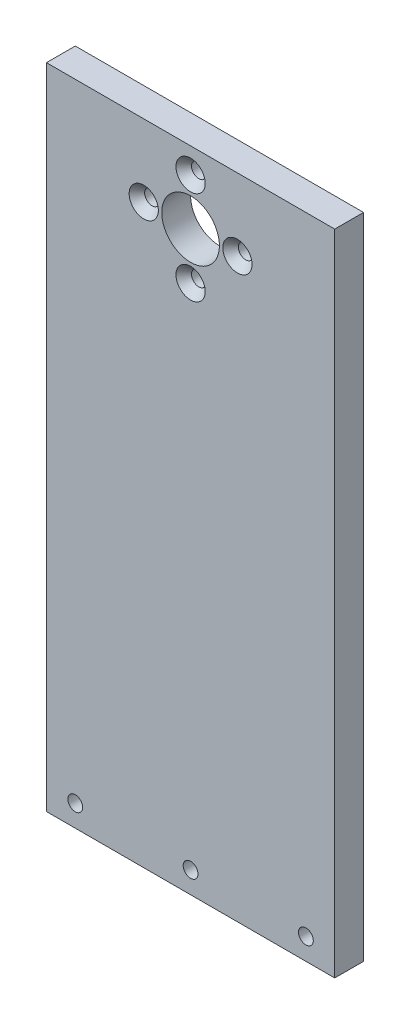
ISO-10303-21;
HEADER;
FILE_DESCRIPTION(('STEP AP214'),'2;1');
FILE_NAME('part.step','',(''),(''),'','','');
FILE_SCHEMA(('AUTOMOTIVE_DESIGN { 1 0 10303 214 1 1 1 1 }'));
ENDSEC;
DATA;
#1=APPLICATION_CONTEXT('core data for automotive mechanical design processes');
#2=APPLICATION_PROTOCOL_DEFINITION('international standard','automotive_design',2000,#1);
#3=PRODUCT_CONTEXT('',#1,'mechanical');
#4=PRODUCT('Part','Part','',(#3));
#5=PRODUCT_RELATED_PRODUCT_CATEGORY('part','',(#4));
#6=PRODUCT_DEFINITION_FORMATION('','',#4);
#7=PRODUCT_DEFINITION_CONTEXT('part definition',#1,'design');
#8=PRODUCT_DEFINITION('design','',#6,#7);
#9=PRODUCT_DEFINITION_SHAPE('','',#8);
#10=(LENGTH_UNIT() NAMED_UNIT(*) SI_UNIT(.MILLI.,.METRE.));
#11=(NAMED_UNIT(*) PLANE_ANGLE_UNIT() SI_UNIT($,.RADIAN.));
#12=(NAMED_UNIT(*) SI_UNIT($,.STERADIAN.) SOLID_ANGLE_UNIT());
#13=UNCERTAINTY_MEASURE_WITH_UNIT(LENGTH_MEASURE(1.E-05),#10,'distance_accuracy_value','');
#14=(GEOMETRIC_REPRESENTATION_CONTEXT(3) GLOBAL_UNCERTAINTY_ASSIGNED_CONTEXT((#13)) GLOBAL_UNIT_ASSIGNED_CONTEXT((#10,
#11,#12)) REPRESENTATION_CONTEXT('',''));
#15=CARTESIAN_POINT('',(0.,0.,0.));
#16=DIRECTION('',(0.,0.,1.));
#17=DIRECTION('',(1.,0.,0.));
#18=AXIS2_PLACEMENT_3D('',#15,#16,#17);
#19=CARTESIAN_POINT('',(-63.5,31.75,12.7));
#20=DIRECTION('',(1.,0.,0.));
#21=DIRECTION('',(0.,1.,0.));
#22=AXIS2_PLACEMENT_3D('',#19,#20,#21);
#23=PLANE('',#22);
#24=DIRECTION('',(0.,-1.,0.));
#25=VECTOR('',#24,1.);
#26=CARTESIAN_POINT('',(-63.5,31.75,0.));
#27=LINE('',#26,#25);
#28=CARTESIAN_POINT('',(-63.5,31.75,0.));
#29=VERTEX_POINT('',#28);
#30=CARTESIAN_POINT('',(-63.5,-254.,0.));
#31=VERTEX_POINT('',#30);
#32=EDGE_CURVE('E95',#29,#31,#27,.T.);
#33=ORIENTED_EDGE('',*,*,#32,.T.);
#34=DIRECTION('',(0.,0.,-1.));
#35=VECTOR('',#34,1.);
#36=CARTESIAN_POINT('',(-63.5,-254.,12.7));
#37=LINE('',#36,#35);
#38=CARTESIAN_POINT('',(-63.5,-254.,12.7));
#39=VERTEX_POINT('',#38);
#40=EDGE_CURVE('E11',#39,#31,#37,.T.);
#41=ORIENTED_EDGE('',*,*,#40,.F.);
#42=DIRECTION('',(0.,-1.,0.));
#43=VECTOR('',#42,1.);
#44=CARTESIAN_POINT('',(-63.5,31.75,12.7));
#45=LINE('',#44,#43);
#46=CARTESIAN_POINT('',(-63.5,31.75,12.7));
#47=VERTEX_POINT('',#46);
#48=EDGE_CURVE('E83',#47,#39,#45,.T.);
#49=ORIENTED_EDGE('',*,*,#48,.F.);
#50=DIRECTION('',(0.,0.,-1.));
#51=VECTOR('',#50,1.);
#52=CARTESIAN_POINT('',(-63.5,31.75,12.7));
#53=LINE('',#52,#51);
#54=EDGE_CURVE('E91',#47,#29,#53,.T.);
#55=ORIENTED_EDGE('',*,*,#54,.T.);
#56=EDGE_LOOP('',(#33,#41,#49,#55));
#57=FACE_BOUND('',#56,.T.);
#58=ADVANCED_FACE('F32',(#57),#23,.F.);
#59=CARTESIAN_POINT('',(-63.5,-254.,12.7));
#60=DIRECTION('',(0.,1.,0.));
#61=DIRECTION('',(0.,0.,1.));
#62=AXIS2_PLACEMENT_3D('',#59,#60,#61);
#63=PLANE('',#62);
#64=DIRECTION('',(1.,0.,0.));
#65=VECTOR('',#64,1.);
#66=CARTESIAN_POINT('',(-63.5,-254.,0.));
#67=LINE('',#66,#65);
#68=CARTESIAN_POINT('',(63.5,-254.,0.));
#69=VERTEX_POINT('',#68);
#70=EDGE_CURVE('E87',#31,#69,#67,.T.);
#71=ORIENTED_EDGE('',*,*,#70,.T.);
#72=DIRECTION('',(0.,0.,-1.));
#73=VECTOR('',#72,1.);
#74=CARTESIAN_POINT('',(63.5,-254.,12.7));
#75=LINE('',#74,#73);
#76=CARTESIAN_POINT('',(63.5,-254.,12.7));
#77=VERTEX_POINT('',#76);
#78=EDGE_CURVE('E40',#77,#69,#75,.T.);
#79=ORIENTED_EDGE('',*,*,#78,.F.);
#80=DIRECTION('',(1.,0.,0.));
#81=VECTOR('',#80,1.);
#82=CARTESIAN_POINT('',(-63.5,-254.,12.7));
#83=LINE('',#82,#81);
#84=EDGE_CURVE('E78',#39,#77,#83,.T.);
#85=ORIENTED_EDGE('',*,*,#84,.F.);
#86=ORIENTED_EDGE('',*,*,#40,.T.);
#87=EDGE_LOOP('',(#71,#79,#85,#86));
#88=FACE_BOUND('',#87,.T.);
#89=ADVANCED_FACE('F86',(#88),#63,.F.);
#90=CARTESIAN_POINT('',(63.5,31.75,12.7));
#91=DIRECTION('',(-1.,0.,0.));
#92=DIRECTION('',(0.,-1.,0.));
#93=AXIS2_PLACEMENT_3D('',#90,#91,#92);
#94=PLANE('',#93);
#95=DIRECTION('',(0.,1.,0.));
#96=VECTOR('',#95,1.);
#97=CARTESIAN_POINT('',(63.5,31.75,0.));
#98=LINE('',#97,#96);
#99=CARTESIAN_POINT('',(63.5,31.75,0.));
#100=VERTEX_POINT('',#99);
#101=EDGE_CURVE('E65',#69,#100,#98,.T.);
#102=ORIENTED_EDGE('',*,*,#101,.T.);
#103=DIRECTION('',(0.,0.,-1.));
#104=VECTOR('',#103,1.);
#105=CARTESIAN_POINT('',(63.5,31.75,12.7));
#106=LINE('',#105,#104);
#107=CARTESIAN_POINT('',(63.5,31.75,12.7));
#108=VERTEX_POINT('',#107);
#109=EDGE_CURVE('E88',#108,#100,#106,.T.);
#110=ORIENTED_EDGE('',*,*,#109,.F.);
#111=DIRECTION('',(0.,1.,0.));
#112=VECTOR('',#111,1.);
#113=CARTESIAN_POINT('',(63.5,31.75,12.7));
#114=LINE('',#113,#112);
#115=EDGE_CURVE('E81',#77,#108,#114,.T.);
#116=ORIENTED_EDGE('',*,*,#115,.F.);
#117=ORIENTED_EDGE('',*,*,#78,.T.);
#118=EDGE_LOOP('',(#102,#110,#116,#117));
#119=FACE_BOUND('',#118,.T.);
#120=ADVANCED_FACE('F89',(#119),#94,.F.);
#121=CARTESIAN_POINT('',(-63.5,31.75,12.7));
#122=DIRECTION('',(0.,-1.,0.));
#123=DIRECTION('',(0.,0.,-1.));
#124=AXIS2_PLACEMENT_3D('',#121,#122,#123);
#125=PLANE('',#124);
#126=DIRECTION('',(-1.,0.,0.));
#127=VECTOR('',#126,1.);
#128=CARTESIAN_POINT('',(-63.5,31.75,0.));
#129=LINE('',#128,#127);
#130=EDGE_CURVE('E71',#100,#29,#129,.T.);
#131=ORIENTED_EDGE('',*,*,#130,.T.);
#132=ORIENTED_EDGE('',*,*,#54,.F.);
#133=DIRECTION('',(-1.,0.,0.));
#134=VECTOR('',#133,1.);
#135=CARTESIAN_POINT('',(-63.5,31.75,12.7));
#136=LINE('',#135,#134);
#137=EDGE_CURVE('E48',#108,#47,#136,.T.);
#138=ORIENTED_EDGE('',*,*,#137,.F.);
#139=ORIENTED_EDGE('',*,*,#109,.T.);
#140=EDGE_LOOP('',(#131,#132,#138,#139));
#141=FACE_BOUND('',#140,.T.);
#142=ADVANCED_FACE('F103',(#141),#125,.F.);
#143=CARTESIAN_POINT('',(0.,0.,12.7));
#144=DIRECTION('',(0.,0.,1.));
#145=DIRECTION('',(1.,0.,0.));
#146=AXIS2_PLACEMENT_3D('',#143,#144,#145);
#147=PLANE('',#146);
#148=CARTESIAN_POINT('',(-50.8,-244.475,12.7));
#149=DIRECTION('',(0.,0.,-1.));
#150=DIRECTION('',(-1.,0.,0.));
#151=AXIS2_PLACEMENT_3D('',#148,#149,#150);
#152=CIRCLE('',#151,3.2639);
#153=CARTESIAN_POINT('',(-54.0639,-244.475,12.7));
#154=VERTEX_POINT('',#153);
#155=EDGE_CURVE('E174',#154,#154,#152,.T.);
#156=ORIENTED_EDGE('',*,*,#155,.T.);
#157=EDGE_LOOP('',(#156));
#158=FACE_BOUND('',#157,.T.);
#159=CARTESIAN_POINT('',(0.,-244.475,12.7));
#160=DIRECTION('',(0.,0.,-1.));
#161=DIRECTION('',(-1.,0.,0.));
#162=AXIS2_PLACEMENT_3D('',#159,#160,#161);
#163=CIRCLE('',#162,3.2639);
#164=CARTESIAN_POINT('',(-3.2639,-244.475,12.7));
#165=VERTEX_POINT('',#164);
#166=EDGE_CURVE('E162',#165,#165,#163,.T.);
#167=ORIENTED_EDGE('',*,*,#166,.T.);
#168=EDGE_LOOP('',(#167));
#169=FACE_BOUND('',#168,.T.);
#170=CARTESIAN_POINT('',(50.8,-244.475,12.7));
#171=DIRECTION('',(0.,0.,-1.));
#172=DIRECTION('',(-1.,0.,0.));
#173=AXIS2_PLACEMENT_3D('',#170,#171,#172);
#174=CIRCLE('',#173,3.2639);
#175=CARTESIAN_POINT('',(47.5361,-244.475,12.7));
#176=VERTEX_POINT('',#175);
#177=EDGE_CURVE('E150',#176,#176,#174,.T.);
#178=ORIENTED_EDGE('',*,*,#177,.T.);
#179=EDGE_LOOP('',(#178));
#180=FACE_BOUND('',#179,.T.);
#181=CARTESIAN_POINT('',(-20.6375,0.,12.7));
#182=DIRECTION('',(0.,0.,1.));
#183=DIRECTION('',(1.,0.,0.));
#184=AXIS2_PLACEMENT_3D('',#181,#182,#183);
#185=CIRCLE('',#184,6.4389);
#186=CARTESIAN_POINT('',(-14.1986,0.,12.7));
#187=VERTEX_POINT('',#186);
#188=EDGE_CURVE('E147',#187,#187,#185,.T.);
#189=ORIENTED_EDGE('',*,*,#188,.F.);
#190=EDGE_LOOP('',(#189));
#191=FACE_BOUND('',#190,.T.);
#192=CARTESIAN_POINT('',(0.,20.6375,12.7));
#193=DIRECTION('',(0.,0.,1.));
#194=DIRECTION('',(1.,0.,0.));
#195=AXIS2_PLACEMENT_3D('',#192,#193,#194);
#196=CIRCLE('',#195,6.4389);
#197=CARTESIAN_POINT('',(6.4389,20.6375,12.7));
#198=VERTEX_POINT('',#197);
#199=EDGE_CURVE('E138',#198,#198,#196,.T.);
#200=ORIENTED_EDGE('',*,*,#199,.F.);
#201=EDGE_LOOP('',(#200));
#202=FACE_BOUND('',#201,.T.);
#203=CARTESIAN_POINT('',(20.6375,0.,12.7));
#204=DIRECTION('',(0.,0.,1.));
#205=DIRECTION('',(1.,0.,0.));
#206=AXIS2_PLACEMENT_3D('',#203,#204,#205);
#207=CIRCLE('',#206,6.4389);
#208=CARTESIAN_POINT('',(27.0764,0.,12.7));
#209=VERTEX_POINT('',#208);
#210=EDGE_CURVE('E129',#209,#209,#207,.T.);
#211=ORIENTED_EDGE('',*,*,#210,.F.);
#212=EDGE_LOOP('',(#211));
#213=FACE_BOUND('',#212,.T.);
#214=CARTESIAN_POINT('',(0.,-20.6375,12.7));
#215=DIRECTION('',(0.,0.,1.));
#216=DIRECTION('',(1.,0.,0.));
#217=AXIS2_PLACEMENT_3D('',#214,#215,#216);
#218=CIRCLE('',#217,6.4389);
#219=CARTESIAN_POINT('',(6.4389,-20.6375,12.7));
#220=VERTEX_POINT('',#219);
#221=EDGE_CURVE('E120',#220,#220,#218,.T.);
#222=ORIENTED_EDGE('',*,*,#221,.F.);
#223=EDGE_LOOP('',(#222));
#224=FACE_BOUND('',#223,.T.);
#225=CARTESIAN_POINT('',(0.,0.,12.7));
#226=DIRECTION('',(0.,0.,1.));
#227=DIRECTION('',(1.,0.,0.));
#228=AXIS2_PLACEMENT_3D('',#225,#226,#227);
#229=CIRCLE('',#228,12.7);
#230=CARTESIAN_POINT('',(12.7,0.,12.7));
#231=VERTEX_POINT('',#230);
#232=EDGE_CURVE('E111',#231,#231,#229,.T.);
#233=ORIENTED_EDGE('',*,*,#232,.F.);
#234=EDGE_LOOP('',(#233));
#235=FACE_BOUND('',#234,.T.);
#236=ORIENTED_EDGE('',*,*,#48,.T.);
#237=ORIENTED_EDGE('',*,*,#84,.T.);
#238=ORIENTED_EDGE('',*,*,#115,.T.);
#239=ORIENTED_EDGE('',*,*,#137,.T.);
#240=EDGE_LOOP('',(#236,#237,#238,#239));
#241=FACE_BOUND('',#240,.T.);
#242=ADVANCED_FACE('F79',(#158,#169,#180,#191,#202,#213,#224,#235,#241),#147,.T.);
#243=CARTESIAN_POINT('',(0.,0.,0.));
#244=DIRECTION('',(0.,0.,1.));
#245=DIRECTION('',(1.,0.,0.));
#246=AXIS2_PLACEMENT_3D('',#243,#244,#245);
#247=PLANE('',#246);
#248=CARTESIAN_POINT('',(-50.8,-244.475,0.));
#249=DIRECTION('',(0.,0.,-1.));
#250=DIRECTION('',(-1.,0.,0.));
#251=AXIS2_PLACEMENT_3D('',#248,#249,#250);
#252=CIRCLE('',#251,5.55625);
#253=CARTESIAN_POINT('',(-56.35625,-244.475,0.));
#254=VERTEX_POINT('',#253);
#255=EDGE_CURVE('E183',#254,#254,#252,.T.);
#256=ORIENTED_EDGE('',*,*,#255,.F.);
#257=EDGE_LOOP('',(#256));
#258=FACE_BOUND('',#257,.T.);
#259=CARTESIAN_POINT('',(0.,-244.475,0.));
#260=DIRECTION('',(0.,0.,-1.));
#261=DIRECTION('',(-1.,0.,0.));
#262=AXIS2_PLACEMENT_3D('',#259,#260,#261);
#263=CIRCLE('',#262,5.55625);
#264=CARTESIAN_POINT('',(-5.55625,-244.475,0.));
#265=VERTEX_POINT('',#264);
#266=EDGE_CURVE('E171',#265,#265,#263,.T.);
#267=ORIENTED_EDGE('',*,*,#266,.F.);
#268=EDGE_LOOP('',(#267));
#269=FACE_BOUND('',#268,.T.);
#270=CARTESIAN_POINT('',(50.8,-244.475,0.));
#271=DIRECTION('',(0.,0.,-1.));
#272=DIRECTION('',(-1.,0.,0.));
#273=AXIS2_PLACEMENT_3D('',#270,#271,#272);
#274=CIRCLE('',#273,5.55625);
#275=CARTESIAN_POINT('',(45.24375,-244.475,0.));
#276=VERTEX_POINT('',#275);
#277=EDGE_CURVE('E159',#276,#276,#274,.T.);
#278=ORIENTED_EDGE('',*,*,#277,.F.);
#279=EDGE_LOOP('',(#278));
#280=FACE_BOUND('',#279,.T.);
#281=CARTESIAN_POINT('',(-20.6375,0.,0.));
#282=DIRECTION('',(0.,0.,1.));
#283=DIRECTION('',(1.,0.,0.));
#284=AXIS2_PLACEMENT_3D('',#281,#282,#283);
#285=CIRCLE('',#284,3.2639);
#286=CARTESIAN_POINT('',(-17.3736,0.,0.));
#287=VERTEX_POINT('',#286);
#288=EDGE_CURVE('E141',#287,#287,#285,.T.);
#289=ORIENTED_EDGE('',*,*,#288,.T.);
#290=EDGE_LOOP('',(#289));
#291=FACE_BOUND('',#290,.T.);
#292=CARTESIAN_POINT('',(0.,20.6375,0.));
#293=DIRECTION('',(0.,0.,1.));
#294=DIRECTION('',(1.,0.,0.));
#295=AXIS2_PLACEMENT_3D('',#292,#293,#294);
#296=CIRCLE('',#295,3.2639);
#297=CARTESIAN_POINT('',(3.26389999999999,20.6375,0.));
#298=VERTEX_POINT('',#297);
#299=EDGE_CURVE('E132',#298,#298,#296,.T.);
#300=ORIENTED_EDGE('',*,*,#299,.T.);
#301=EDGE_LOOP('',(#300));
#302=FACE_BOUND('',#301,.T.);
#303=CARTESIAN_POINT('',(20.6375,0.,0.));
#304=DIRECTION('',(0.,0.,1.));
#305=DIRECTION('',(1.,0.,0.));
#306=AXIS2_PLACEMENT_3D('',#303,#304,#305);
#307=CIRCLE('',#306,3.2639);
#308=CARTESIAN_POINT('',(23.9014,0.,0.));
#309=VERTEX_POINT('',#308);
#310=EDGE_CURVE('E123',#309,#309,#307,.T.);
#311=ORIENTED_EDGE('',*,*,#310,.T.);
#312=EDGE_LOOP('',(#311));
#313=FACE_BOUND('',#312,.T.);
#314=CARTESIAN_POINT('',(0.,-20.6375,0.));
#315=DIRECTION('',(0.,0.,1.));
#316=DIRECTION('',(1.,0.,0.));
#317=AXIS2_PLACEMENT_3D('',#314,#315,#316);
#318=CIRCLE('',#317,3.2639);
#319=CARTESIAN_POINT('',(3.26389999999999,-20.6375,0.));
#320=VERTEX_POINT('',#319);
#321=EDGE_CURVE('E114',#320,#320,#318,.T.);
#322=ORIENTED_EDGE('',*,*,#321,.T.);
#323=EDGE_LOOP('',(#322));
#324=FACE_BOUND('',#323,.T.);
#325=CARTESIAN_POINT('',(0.,0.,0.));
#326=DIRECTION('',(0.,0.,1.));
#327=DIRECTION('',(1.,0.,0.));
#328=AXIS2_PLACEMENT_3D('',#325,#326,#327);
#329=CIRCLE('',#328,12.7);
#330=CARTESIAN_POINT('',(12.7,0.,0.));
#331=VERTEX_POINT('',#330);
#332=EDGE_CURVE('E98',#331,#331,#329,.T.);
#333=ORIENTED_EDGE('',*,*,#332,.T.);
#334=EDGE_LOOP('',(#333));
#335=FACE_BOUND('',#334,.T.);
#336=ORIENTED_EDGE('',*,*,#32,.F.);
#337=ORIENTED_EDGE('',*,*,#130,.F.);
#338=ORIENTED_EDGE('',*,*,#101,.F.);
#339=ORIENTED_EDGE('',*,*,#70,.F.);
#340=EDGE_LOOP('',(#336,#337,#338,#339));
#341=FACE_BOUND('',#340,.T.);
#342=ADVANCED_FACE('F106',(#258,#269,#280,#291,#302,#313,#324,#335,#341),#247,.F.);
#343=CARTESIAN_POINT('',(0.,0.,12.7));
#344=DIRECTION('',(0.,0.,1.));
#345=DIRECTION('',(1.,0.,0.));
#346=AXIS2_PLACEMENT_3D('',#343,#344,#345);
#347=CYLINDRICAL_SURFACE('',#346,12.7);
#348=ORIENTED_EDGE('',*,*,#332,.F.);
#349=EDGE_LOOP('',(#348));
#350=FACE_BOUND('',#349,.T.);
#351=ORIENTED_EDGE('',*,*,#232,.T.);
#352=EDGE_LOOP('',(#351));
#353=FACE_BOUND('',#352,.T.);
#354=ADVANCED_FACE('F191',(#350,#353),#347,.F.);
#355=CARTESIAN_POINT('',(0.,-20.6375,12.7));
#356=DIRECTION('',(0.,0.,1.));
#357=DIRECTION('',(1.,0.,0.));
#358=AXIS2_PLACEMENT_3D('',#355,#356,#357);
#359=CYLINDRICAL_SURFACE('',#358,3.2639);
#360=ORIENTED_EDGE('',*,*,#321,.F.);
#361=EDGE_LOOP('',(#360));
#362=FACE_BOUND('',#361,.T.);
#363=CARTESIAN_POINT('',(0.,-20.6375,9.04758030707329));
#364=DIRECTION('',(0.,0.,1.));
#365=DIRECTION('',(1.,0.,0.));
#366=AXIS2_PLACEMENT_3D('',#363,#364,#365);
#367=CIRCLE('',#366,3.2639);
#368=CARTESIAN_POINT('',(3.2639,-20.6375,9.04758030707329));
#369=VERTEX_POINT('',#368);
#370=EDGE_CURVE('E117',#369,#369,#367,.T.);
#371=ORIENTED_EDGE('',*,*,#370,.T.);
#372=EDGE_LOOP('',(#371));
#373=FACE_BOUND('',#372,.T.);
#374=ADVANCED_FACE('F209',(#362,#373),#359,.F.);
#375=CARTESIAN_POINT('',(0.,-20.6375,12.7));
#376=DIRECTION('',(0.,0.,1.));
#377=DIRECTION('',(1.,0.,0.));
#378=AXIS2_PLACEMENT_3D('',#375,#376,#377);
#379=CONICAL_SURFACE('',#378,6.4389,0.715584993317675);
#380=ORIENTED_EDGE('',*,*,#370,.F.);
#381=EDGE_LOOP('',(#380));
#382=FACE_BOUND('',#381,.T.);
#383=ORIENTED_EDGE('',*,*,#221,.T.);
#384=EDGE_LOOP('',(#383));
#385=FACE_BOUND('',#384,.T.);
#386=ADVANCED_FACE('F257',(#382,#385),#379,.F.);
#387=CARTESIAN_POINT('',(20.6375,0.,12.7));
#388=DIRECTION('',(0.,0.,1.));
#389=DIRECTION('',(1.,0.,0.));
#390=AXIS2_PLACEMENT_3D('',#387,#388,#389);
#391=CYLINDRICAL_SURFACE('',#390,3.2639);
#392=ORIENTED_EDGE('',*,*,#310,.F.);
#393=EDGE_LOOP('',(#392));
#394=FACE_BOUND('',#393,.T.);
#395=CARTESIAN_POINT('',(20.6375,0.,9.04758030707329));
#396=DIRECTION('',(0.,0.,1.));
#397=DIRECTION('',(1.,0.,0.));
#398=AXIS2_PLACEMENT_3D('',#395,#396,#397);
#399=CIRCLE('',#398,3.2639);
#400=CARTESIAN_POINT('',(23.9014,0.,9.04758030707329));
#401=VERTEX_POINT('',#400);
#402=EDGE_CURVE('E126',#401,#401,#399,.T.);
#403=ORIENTED_EDGE('',*,*,#402,.T.);
#404=EDGE_LOOP('',(#403));
#405=FACE_BOUND('',#404,.T.);
#406=ADVANCED_FACE('F265',(#394,#405),#391,.F.);
#407=CARTESIAN_POINT('',(20.6375,0.,12.7));
#408=DIRECTION('',(0.,0.,1.));
#409=DIRECTION('',(1.,0.,0.));
#410=AXIS2_PLACEMENT_3D('',#407,#408,#409);
#411=CONICAL_SURFACE('',#410,6.4389,0.715584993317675);
#412=ORIENTED_EDGE('',*,*,#402,.F.);
#413=EDGE_LOOP('',(#412));
#414=FACE_BOUND('',#413,.T.);
#415=ORIENTED_EDGE('',*,*,#210,.T.);
#416=EDGE_LOOP('',(#415));
#417=FACE_BOUND('',#416,.T.);
#418=ADVANCED_FACE('F273',(#414,#417),#411,.F.);
#419=CARTESIAN_POINT('',(0.,20.6375,12.7));
#420=DIRECTION('',(0.,0.,1.));
#421=DIRECTION('',(1.,0.,0.));
#422=AXIS2_PLACEMENT_3D('',#419,#420,#421);
#423=CYLINDRICAL_SURFACE('',#422,3.2639);
#424=ORIENTED_EDGE('',*,*,#299,.F.);
#425=EDGE_LOOP('',(#424));
#426=FACE_BOUND('',#425,.T.);
#427=CARTESIAN_POINT('',(0.,20.6375,9.04758030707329));
#428=DIRECTION('',(0.,0.,1.));
#429=DIRECTION('',(1.,0.,0.));
#430=AXIS2_PLACEMENT_3D('',#427,#428,#429);
#431=CIRCLE('',#430,3.2639);
#432=CARTESIAN_POINT('',(3.26389999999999,20.6375,9.04758030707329));
#433=VERTEX_POINT('',#432);
#434=EDGE_CURVE('E135',#433,#433,#431,.T.);
#435=ORIENTED_EDGE('',*,*,#434,.T.);
#436=EDGE_LOOP('',(#435));
#437=FACE_BOUND('',#436,.T.);
#438=ADVANCED_FACE('F281',(#426,#437),#423,.F.);
#439=CARTESIAN_POINT('',(0.,20.6375,12.7));
#440=DIRECTION('',(0.,0.,1.));
#441=DIRECTION('',(1.,0.,0.));
#442=AXIS2_PLACEMENT_3D('',#439,#440,#441);
#443=CONICAL_SURFACE('',#442,6.4389,0.715584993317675);
#444=ORIENTED_EDGE('',*,*,#434,.F.);
#445=EDGE_LOOP('',(#444));
#446=FACE_BOUND('',#445,.T.);
#447=ORIENTED_EDGE('',*,*,#199,.T.);
#448=EDGE_LOOP('',(#447));
#449=FACE_BOUND('',#448,.T.);
#450=ADVANCED_FACE('F289',(#446,#449),#443,.F.);
#451=CARTESIAN_POINT('',(-20.6375,0.,12.7));
#452=DIRECTION('',(0.,0.,1.));
#453=DIRECTION('',(1.,0.,0.));
#454=AXIS2_PLACEMENT_3D('',#451,#452,#453);
#455=CYLINDRICAL_SURFACE('',#454,3.2639);
#456=ORIENTED_EDGE('',*,*,#288,.F.);
#457=EDGE_LOOP('',(#456));
#458=FACE_BOUND('',#457,.T.);
#459=CARTESIAN_POINT('',(-20.6375,0.,9.04758030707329));
#460=DIRECTION('',(0.,0.,1.));
#461=DIRECTION('',(1.,0.,0.));
#462=AXIS2_PLACEMENT_3D('',#459,#460,#461);
#463=CIRCLE('',#462,3.2639);
#464=CARTESIAN_POINT('',(-17.3736,0.,9.04758030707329));
#465=VERTEX_POINT('',#464);
#466=EDGE_CURVE('E144',#465,#465,#463,.T.);
#467=ORIENTED_EDGE('',*,*,#466,.T.);
#468=EDGE_LOOP('',(#467));
#469=FACE_BOUND('',#468,.T.);
#470=ADVANCED_FACE('F297',(#458,#469),#455,.F.);
#471=CARTESIAN_POINT('',(-20.6375,0.,12.7));
#472=DIRECTION('',(0.,0.,1.));
#473=DIRECTION('',(1.,0.,0.));
#474=AXIS2_PLACEMENT_3D('',#471,#472,#473);
#475=CONICAL_SURFACE('',#474,6.4389,0.715584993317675);
#476=ORIENTED_EDGE('',*,*,#466,.F.);
#477=EDGE_LOOP('',(#476));
#478=FACE_BOUND('',#477,.T.);
#479=ORIENTED_EDGE('',*,*,#188,.T.);
#480=EDGE_LOOP('',(#479));
#481=FACE_BOUND('',#480,.T.);
#482=ADVANCED_FACE('F305',(#478,#481),#475,.F.);
#483=CARTESIAN_POINT('',(50.8,-244.475,0.));
#484=DIRECTION('',(0.,0.,-1.));
#485=DIRECTION('',(-1.,0.,0.));
#486=AXIS2_PLACEMENT_3D('',#483,#484,#485);
#487=CYLINDRICAL_SURFACE('',#486,3.2639);
#488=ORIENTED_EDGE('',*,*,#177,.F.);
#489=EDGE_LOOP('',(#488));
#490=FACE_BOUND('',#489,.T.);
#491=CARTESIAN_POINT('',(50.8,-244.475,6.35));
#492=DIRECTION('',(0.,0.,-1.));
#493=DIRECTION('',(-1.,0.,0.));
#494=AXIS2_PLACEMENT_3D('',#491,#492,#493);
#495=CIRCLE('',#494,3.2639);
#496=CARTESIAN_POINT('',(47.5361,-244.475,6.35));
#497=VERTEX_POINT('',#496);
#498=EDGE_CURVE('E153',#497,#497,#495,.T.);
#499=ORIENTED_EDGE('',*,*,#498,.T.);
#500=EDGE_LOOP('',(#499));
#501=FACE_BOUND('',#500,.T.);
#502=ADVANCED_FACE('F312',(#490,#501),#487,.F.);
#503=CARTESIAN_POINT('',(54.0639,-244.475,6.35));
#504=DIRECTION('',(0.,0.,1.));
#505=DIRECTION('',(1.,0.,0.));
#506=AXIS2_PLACEMENT_3D('',#503,#504,#505);
#507=PLANE('',#506);
#508=ORIENTED_EDGE('',*,*,#498,.F.);
#509=EDGE_LOOP('',(#508));
#510=FACE_BOUND('',#509,.T.);
#511=CARTESIAN_POINT('',(50.8,-244.475,6.35));
#512=DIRECTION('',(0.,0.,-1.));
#513=DIRECTION('',(-1.,0.,0.));
#514=AXIS2_PLACEMENT_3D('',#511,#512,#513);
#515=CIRCLE('',#514,5.55625);
#516=CARTESIAN_POINT('',(45.24375,-244.475,6.35));
#517=VERTEX_POINT('',#516);
#518=EDGE_CURVE('E156',#517,#517,#515,.T.);
#519=ORIENTED_EDGE('',*,*,#518,.T.);
#520=EDGE_LOOP('',(#519));
#521=FACE_BOUND('',#520,.T.);
#522=ADVANCED_FACE('F319',(#510,#521),#507,.F.);
#523=CARTESIAN_POINT('',(50.8,-244.475,0.));
#524=DIRECTION('',(0.,0.,-1.));
#525=DIRECTION('',(-1.,0.,0.));
#526=AXIS2_PLACEMENT_3D('',#523,#524,#525);
#527=CYLINDRICAL_SURFACE('',#526,5.55625);
#528=ORIENTED_EDGE('',*,*,#518,.F.);
#529=EDGE_LOOP('',(#528));
#530=FACE_BOUND('',#529,.T.);
#531=ORIENTED_EDGE('',*,*,#277,.T.);
#532=EDGE_LOOP('',(#531));
#533=FACE_BOUND('',#532,.T.);
#534=ADVANCED_FACE('F327',(#530,#533),#527,.F.);
#535=CARTESIAN_POINT('',(0.,-244.475,0.));
#536=DIRECTION('',(0.,0.,-1.));
#537=DIRECTION('',(-1.,0.,0.));
#538=AXIS2_PLACEMENT_3D('',#535,#536,#537);
#539=CYLINDRICAL_SURFACE('',#538,3.2639);
#540=ORIENTED_EDGE('',*,*,#166,.F.);
#541=EDGE_LOOP('',(#540));
#542=FACE_BOUND('',#541,.T.);
#543=CARTESIAN_POINT('',(0.,-244.475,6.35));
#544=DIRECTION('',(0.,0.,-1.));
#545=DIRECTION('',(-1.,0.,0.));
#546=AXIS2_PLACEMENT_3D('',#543,#544,#545);
#547=CIRCLE('',#546,3.2639);
#548=CARTESIAN_POINT('',(-3.2639,-244.475,6.35));
#549=VERTEX_POINT('',#548);
#550=EDGE_CURVE('E165',#549,#549,#547,.T.);
#551=ORIENTED_EDGE('',*,*,#550,.T.);
#552=EDGE_LOOP('',(#551));
#553=FACE_BOUND('',#552,.T.);
#554=ADVANCED_FACE('F335',(#542,#553),#539,.F.);
#555=CARTESIAN_POINT('',(3.2639,-244.475,6.35));
#556=DIRECTION('',(0.,0.,1.));
#557=DIRECTION('',(1.,0.,0.));
#558=AXIS2_PLACEMENT_3D('',#555,#556,#557);
#559=PLANE('',#558);
#560=ORIENTED_EDGE('',*,*,#550,.F.);
#561=EDGE_LOOP('',(#560));
#562=FACE_BOUND('',#561,.T.);
#563=CARTESIAN_POINT('',(0.,-244.475,6.35));
#564=DIRECTION('',(0.,0.,-1.));
#565=DIRECTION('',(-1.,0.,0.));
#566=AXIS2_PLACEMENT_3D('',#563,#564,#565);
#567=CIRCLE('',#566,5.55625);
#568=CARTESIAN_POINT('',(-5.55625,-244.475,6.35));
#569=VERTEX_POINT('',#568);
#570=EDGE_CURVE('E168',#569,#569,#567,.T.);
#571=ORIENTED_EDGE('',*,*,#570,.T.);
#572=EDGE_LOOP('',(#571));
#573=FACE_BOUND('',#572,.T.);
#574=ADVANCED_FACE('F343',(#562,#573),#559,.F.);
#575=CARTESIAN_POINT('',(0.,-244.475,0.));
#576=DIRECTION('',(0.,0.,-1.));
#577=DIRECTION('',(-1.,0.,0.));
#578=AXIS2_PLACEMENT_3D('',#575,#576,#577);
#579=CYLINDRICAL_SURFACE('',#578,5.55625);
#580=ORIENTED_EDGE('',*,*,#570,.F.);
#581=EDGE_LOOP('',(#580));
#582=FACE_BOUND('',#581,.T.);
#583=ORIENTED_EDGE('',*,*,#266,.T.);
#584=EDGE_LOOP('',(#583));
#585=FACE_BOUND('',#584,.T.);
#586=ADVANCED_FACE('F351',(#582,#585),#579,.F.);
#587=CARTESIAN_POINT('',(-50.8,-244.475,0.));
#588=DIRECTION('',(0.,0.,-1.));
#589=DIRECTION('',(-1.,0.,0.));
#590=AXIS2_PLACEMENT_3D('',#587,#588,#589);
#591=CYLINDRICAL_SURFACE('',#590,3.2639);
#592=ORIENTED_EDGE('',*,*,#155,.F.);
#593=EDGE_LOOP('',(#592));
#594=FACE_BOUND('',#593,.T.);
#595=CARTESIAN_POINT('',(-50.8,-244.475,6.35));
#596=DIRECTION('',(0.,0.,-1.));
#597=DIRECTION('',(-1.,0.,0.));
#598=AXIS2_PLACEMENT_3D('',#595,#596,#597);
#599=CIRCLE('',#598,3.2639);
#600=CARTESIAN_POINT('',(-54.0639,-244.475,6.35));
#601=VERTEX_POINT('',#600);
#602=EDGE_CURVE('E177',#601,#601,#599,.T.);
#603=ORIENTED_EDGE('',*,*,#602,.T.);
#604=EDGE_LOOP('',(#603));
#605=FACE_BOUND('',#604,.T.);
#606=ADVANCED_FACE('F359',(#594,#605),#591,.F.);
#607=CARTESIAN_POINT('',(-47.5361,-244.475,6.35));
#608=DIRECTION('',(0.,0.,1.));
#609=DIRECTION('',(1.,0.,0.));
#610=AXIS2_PLACEMENT_3D('',#607,#608,#609);
#611=PLANE('',#610);
#612=ORIENTED_EDGE('',*,*,#602,.F.);
#613=EDGE_LOOP('',(#612));
#614=FACE_BOUND('',#613,.T.);
#615=CARTESIAN_POINT('',(-50.8,-244.475,6.35));
#616=DIRECTION('',(0.,0.,-1.));
#617=DIRECTION('',(-1.,0.,0.));
#618=AXIS2_PLACEMENT_3D('',#615,#616,#617);
#619=CIRCLE('',#618,5.55625);
#620=CARTESIAN_POINT('',(-56.35625,-244.475,6.35));
#621=VERTEX_POINT('',#620);
#622=EDGE_CURVE('E180',#621,#621,#619,.T.);
#623=ORIENTED_EDGE('',*,*,#622,.T.);
#624=EDGE_LOOP('',(#623));
#625=FACE_BOUND('',#624,.T.);
#626=ADVANCED_FACE('F367',(#614,#625),#611,.F.);
#627=CARTESIAN_POINT('',(-50.8,-244.475,0.));
#628=DIRECTION('',(0.,0.,-1.));
#629=DIRECTION('',(-1.,0.,0.));
#630=AXIS2_PLACEMENT_3D('',#627,#628,#629);
#631=CYLINDRICAL_SURFACE('',#630,5.55625);
#632=ORIENTED_EDGE('',*,*,#622,.F.);
#633=EDGE_LOOP('',(#632));
#634=FACE_BOUND('',#633,.T.);
#635=ORIENTED_EDGE('',*,*,#255,.T.);
#636=EDGE_LOOP('',(#635));
#637=FACE_BOUND('',#636,.T.);
#638=ADVANCED_FACE('F187',(#634,#637),#631,.F.);
#639=CLOSED_SHELL('',(#58,#89,#120,#142,#242,#342,#354,#374,#386,#406,#418,#438,#450,#470,#482,
#502,#522,#534,#554,#574,#586,#606,#626,#638));
#640=MANIFOLD_SOLID_BREP('B2',#639);
#641=ADVANCED_BREP_SHAPE_REPRESENTATION('',(#18,#640),#14);
#642=SHAPE_DEFINITION_REPRESENTATION(#9,#641);
ENDSEC;
END-ISO-10303-21;
